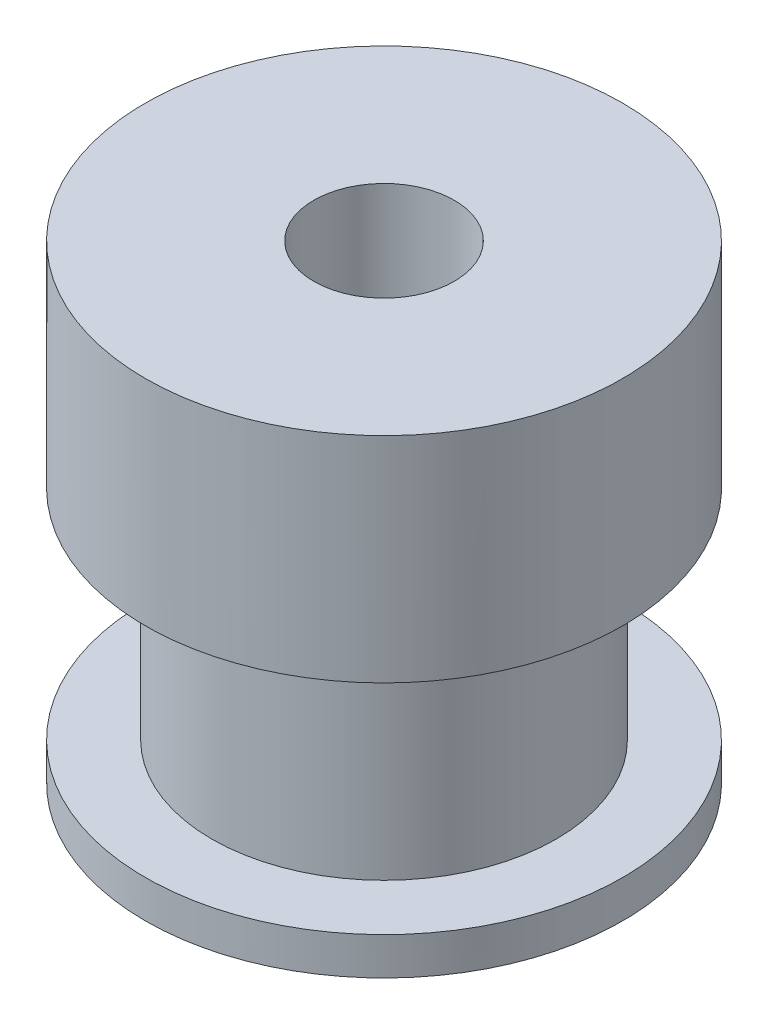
ISO-10303-21;
HEADER;
FILE_DESCRIPTION(('STEP AP214'),'2;1');
FILE_NAME('part.step','',(''),(''),'','','');
FILE_SCHEMA(('AUTOMOTIVE_DESIGN { 1 0 10303 214 1 1 1 1 }'));
ENDSEC;
DATA;
#1=APPLICATION_CONTEXT('core data for automotive mechanical design processes');
#2=APPLICATION_PROTOCOL_DEFINITION('international standard','automotive_design',2000,#1);
#3=PRODUCT_CONTEXT('',#1,'mechanical');
#4=PRODUCT('Part','Part','',(#3));
#5=PRODUCT_RELATED_PRODUCT_CATEGORY('part','',(#4));
#6=PRODUCT_DEFINITION_FORMATION('','',#4);
#7=PRODUCT_DEFINITION_CONTEXT('part definition',#1,'design');
#8=PRODUCT_DEFINITION('design','',#6,#7);
#9=PRODUCT_DEFINITION_SHAPE('','',#8);
#10=(LENGTH_UNIT() NAMED_UNIT(*) SI_UNIT(.MILLI.,.METRE.));
#11=(NAMED_UNIT(*) PLANE_ANGLE_UNIT() SI_UNIT($,.RADIAN.));
#12=(NAMED_UNIT(*) SI_UNIT($,.STERADIAN.) SOLID_ANGLE_UNIT());
#13=UNCERTAINTY_MEASURE_WITH_UNIT(LENGTH_MEASURE(1.E-05),#10,'distance_accuracy_value','');
#14=(GEOMETRIC_REPRESENTATION_CONTEXT(3) GLOBAL_UNCERTAINTY_ASSIGNED_CONTEXT((#13)) GLOBAL_UNIT_ASSIGNED_CONTEXT((#10,
#11,#12)) REPRESENTATION_CONTEXT('',''));
#15=CARTESIAN_POINT('',(0.,0.,0.));
#16=DIRECTION('',(0.,0.,1.));
#17=DIRECTION('',(1.,0.,0.));
#18=AXIS2_PLACEMENT_3D('',#15,#16,#17);
#19=CARTESIAN_POINT('',(0.,15.875,0.));
#20=DIRECTION('',(0.,-1.,0.));
#21=DIRECTION('',(0.,0.,-1.));
#22=AXIS2_PLACEMENT_3D('',#19,#20,#21);
#23=CYLINDRICAL_SURFACE('',#22,8.0645);
#24=CARTESIAN_POINT('',(0.,15.875,0.));
#25=DIRECTION('',(0.,1.,0.));
#26=DIRECTION('',(0.,0.,1.));
#27=AXIS2_PLACEMENT_3D('',#24,#25,#26);
#28=CIRCLE('',#27,8.0645);
#29=CARTESIAN_POINT('',(0.,15.875,8.0645));
#30=VERTEX_POINT('',#29);
#31=EDGE_CURVE('E10',#30,#30,#28,.T.);
#32=ORIENTED_EDGE('',*,*,#31,.F.);
#33=EDGE_LOOP('',(#32));
#34=FACE_BOUND('',#33,.T.);
#35=CARTESIAN_POINT('',(0.,8.636,0.));
#36=DIRECTION('',(0.,-1.,0.));
#37=DIRECTION('',(0.,0.,-1.));
#38=AXIS2_PLACEMENT_3D('',#35,#36,#37);
#39=CIRCLE('',#38,8.0645);
#40=CARTESIAN_POINT('',(0.,8.636,-8.0645));
#41=VERTEX_POINT('',#40);
#42=EDGE_CURVE('E40',#41,#41,#39,.T.);
#43=ORIENTED_EDGE('',*,*,#42,.F.);
#44=EDGE_LOOP('',(#43));
#45=FACE_BOUND('',#44,.T.);
#46=ADVANCED_FACE('F30',(#34,#45),#23,.T.);
#47=CARTESIAN_POINT('',(0.,15.875,0.));
#48=DIRECTION('',(0.,1.,0.));
#49=DIRECTION('',(0.,0.,1.));
#50=AXIS2_PLACEMENT_3D('',#47,#48,#49);
#51=PLANE('',#50);
#52=CARTESIAN_POINT('',(0.,15.875,0.));
#53=DIRECTION('',(0.,1.,0.));
#54=DIRECTION('',(0.,0.,1.));
#55=AXIS2_PLACEMENT_3D('',#52,#53,#54);
#56=CIRCLE('',#55,2.3749);
#57=CARTESIAN_POINT('',(0.,15.875,2.3749));
#58=VERTEX_POINT('',#57);
#59=EDGE_CURVE('E54',#58,#58,#56,.T.);
#60=ORIENTED_EDGE('',*,*,#59,.F.);
#61=EDGE_LOOP('',(#60));
#62=FACE_BOUND('',#61,.T.);
#63=ORIENTED_EDGE('',*,*,#31,.T.);
#64=EDGE_LOOP('',(#63));
#65=FACE_BOUND('',#64,.T.);
#66=ADVANCED_FACE('F70',(#62,#65),#51,.T.);
#67=CARTESIAN_POINT('',(0.,8.636,8.0645));
#68=DIRECTION('',(0.,-1.,0.));
#69=DIRECTION('',(0.,0.,-1.));
#70=AXIS2_PLACEMENT_3D('',#67,#68,#69);
#71=PLANE('',#70);
#72=ORIENTED_EDGE('',*,*,#42,.T.);
#73=EDGE_LOOP('',(#72));
#74=FACE_BOUND('',#73,.T.);
#75=CARTESIAN_POINT('',(0.,8.636,0.));
#76=DIRECTION('',(0.,-1.,0.));
#77=DIRECTION('',(0.,0.,-1.));
#78=AXIS2_PLACEMENT_3D('',#75,#76,#77);
#79=CIRCLE('',#78,5.8166);
#80=CARTESIAN_POINT('',(0.,8.636,-5.8166));
#81=VERTEX_POINT('',#80);
#82=EDGE_CURVE('E44',#81,#81,#79,.T.);
#83=ORIENTED_EDGE('',*,*,#82,.F.);
#84=EDGE_LOOP('',(#83));
#85=FACE_BOUND('',#84,.T.);
#86=ADVANCED_FACE('F72',(#74,#85),#71,.T.);
#87=CARTESIAN_POINT('',(0.,0.,0.));
#88=DIRECTION('',(0.,-1.,0.));
#89=DIRECTION('',(0.,0.,-1.));
#90=AXIS2_PLACEMENT_3D('',#87,#88,#89);
#91=CYLINDRICAL_SURFACE('',#90,5.8166);
#92=ORIENTED_EDGE('',*,*,#82,.T.);
#93=EDGE_LOOP('',(#92));
#94=FACE_BOUND('',#93,.T.);
#95=CARTESIAN_POINT('',(0.,1.27,0.));
#96=DIRECTION('',(0.,-1.,0.));
#97=DIRECTION('',(0.,0.,-1.));
#98=AXIS2_PLACEMENT_3D('',#95,#96,#97);
#99=CIRCLE('',#98,5.8166);
#100=CARTESIAN_POINT('',(0.,1.27,-5.8166));
#101=VERTEX_POINT('',#100);
#102=EDGE_CURVE('E47',#101,#101,#99,.T.);
#103=ORIENTED_EDGE('',*,*,#102,.F.);
#104=EDGE_LOOP('',(#103));
#105=FACE_BOUND('',#104,.T.);
#106=ADVANCED_FACE('F78',(#94,#105),#91,.T.);
#107=CARTESIAN_POINT('',(0.,1.27,8.0645));
#108=DIRECTION('',(0.,1.,0.));
#109=DIRECTION('',(0.,0.,1.));
#110=AXIS2_PLACEMENT_3D('',#107,#108,#109);
#111=PLANE('',#110);
#112=ORIENTED_EDGE('',*,*,#102,.T.);
#113=EDGE_LOOP('',(#112));
#114=FACE_BOUND('',#113,.T.);
#115=CARTESIAN_POINT('',(0.,1.27,0.));
#116=DIRECTION('',(0.,-1.,0.));
#117=DIRECTION('',(0.,0.,-1.));
#118=AXIS2_PLACEMENT_3D('',#115,#116,#117);
#119=CIRCLE('',#118,8.0645);
#120=CARTESIAN_POINT('',(0.,1.27,-8.0645));
#121=VERTEX_POINT('',#120);
#122=EDGE_CURVE('E50',#121,#121,#119,.T.);
#123=ORIENTED_EDGE('',*,*,#122,.F.);
#124=EDGE_LOOP('',(#123));
#125=FACE_BOUND('',#124,.T.);
#126=ADVANCED_FACE('F84',(#114,#125),#111,.T.);
#127=CARTESIAN_POINT('',(0.,0.,0.));
#128=DIRECTION('',(0.,1.,0.));
#129=DIRECTION('',(0.,0.,1.));
#130=AXIS2_PLACEMENT_3D('',#127,#128,#129);
#131=PLANE('',#130);
#132=CARTESIAN_POINT('',(0.,0.,0.));
#133=DIRECTION('',(0.,1.,0.));
#134=DIRECTION('',(0.,0.,1.));
#135=AXIS2_PLACEMENT_3D('',#132,#133,#134);
#136=CIRCLE('',#135,2.3749);
#137=CARTESIAN_POINT('',(0.,0.,2.3749));
#138=VERTEX_POINT('',#137);
#139=EDGE_CURVE('E53',#138,#138,#136,.T.);
#140=ORIENTED_EDGE('',*,*,#139,.T.);
#141=EDGE_LOOP('',(#140));
#142=FACE_BOUND('',#141,.T.);
#143=CARTESIAN_POINT('',(0.,0.,0.));
#144=DIRECTION('',(0.,1.,0.));
#145=DIRECTION('',(0.,0.,1.));
#146=AXIS2_PLACEMENT_3D('',#143,#144,#145);
#147=CIRCLE('',#146,8.0645);
#148=CARTESIAN_POINT('',(0.,0.,8.0645));
#149=VERTEX_POINT('',#148);
#150=EDGE_CURVE('E33',#149,#149,#147,.T.);
#151=ORIENTED_EDGE('',*,*,#150,.F.);
#152=EDGE_LOOP('',(#151));
#153=FACE_BOUND('',#152,.T.);
#154=ADVANCED_FACE('F60',(#142,#153),#131,.F.);
#155=ORIENTED_EDGE('',*,*,#150,.T.);
#156=EDGE_LOOP('',(#155));
#157=FACE_BOUND('',#156,.T.);
#158=ORIENTED_EDGE('',*,*,#122,.T.);
#159=EDGE_LOOP('',(#158));
#160=FACE_BOUND('',#159,.T.);
#161=ADVANCED_FACE('F66',(#157,#160),#23,.T.);
#162=CARTESIAN_POINT('',(0.,0.,0.));
#163=DIRECTION('',(0.,1.,0.));
#164=DIRECTION('',(0.,0.,1.));
#165=AXIS2_PLACEMENT_3D('',#162,#163,#164);
#166=CYLINDRICAL_SURFACE('',#165,2.3749);
#167=ORIENTED_EDGE('',*,*,#139,.F.);
#168=EDGE_LOOP('',(#167));
#169=FACE_BOUND('',#168,.T.);
#170=ORIENTED_EDGE('',*,*,#59,.T.);
#171=EDGE_LOOP('',(#170));
#172=FACE_BOUND('',#171,.T.);
#173=ADVANCED_FACE('F63',(#169,#172),#166,.F.);
#174=CLOSED_SHELL('',(#46,#66,#86,#106,#126,#154,#161,#173));
#175=MANIFOLD_SOLID_BREP('B2',#174);
#176=ADVANCED_BREP_SHAPE_REPRESENTATION('',(#18,#175),#14);
#177=SHAPE_DEFINITION_REPRESENTATION(#9,#176);
ENDSEC;
END-ISO-10303-21;
